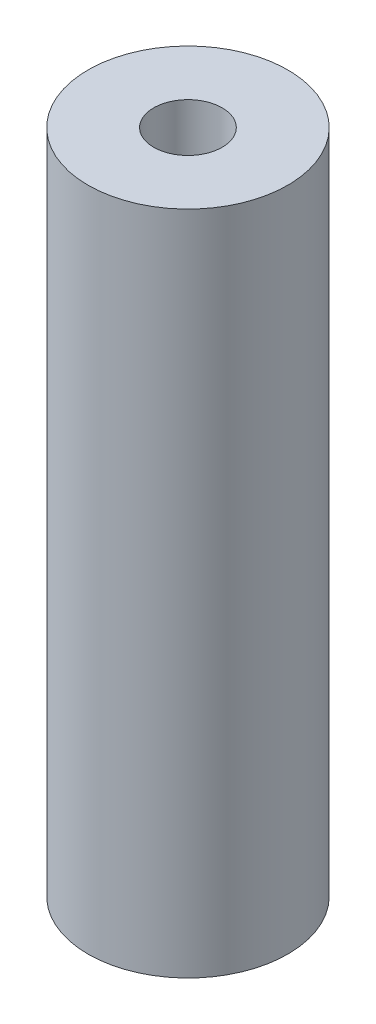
ISO-10303-21;
HEADER;
FILE_DESCRIPTION(('STEP AP214'),'2;1');
FILE_NAME('part.step','',(''),(''),'','','');
FILE_SCHEMA(('AUTOMOTIVE_DESIGN { 1 0 10303 214 1 1 1 1 }'));
ENDSEC;
DATA;
#1=APPLICATION_CONTEXT('core data for automotive mechanical design processes');
#2=APPLICATION_PROTOCOL_DEFINITION('international standard','automotive_design',2000,#1);
#3=PRODUCT_CONTEXT('',#1,'mechanical');
#4=PRODUCT('Part','Part','',(#3));
#5=PRODUCT_RELATED_PRODUCT_CATEGORY('part','',(#4));
#6=PRODUCT_DEFINITION_FORMATION('','',#4);
#7=PRODUCT_DEFINITION_CONTEXT('part definition',#1,'design');
#8=PRODUCT_DEFINITION('design','',#6,#7);
#9=PRODUCT_DEFINITION_SHAPE('','',#8);
#10=(LENGTH_UNIT() NAMED_UNIT(*) SI_UNIT(.MILLI.,.METRE.));
#11=(NAMED_UNIT(*) PLANE_ANGLE_UNIT() SI_UNIT($,.RADIAN.));
#12=(NAMED_UNIT(*) SI_UNIT($,.STERADIAN.) SOLID_ANGLE_UNIT());
#13=UNCERTAINTY_MEASURE_WITH_UNIT(LENGTH_MEASURE(1.E-05),#10,'distance_accuracy_value','');
#14=(GEOMETRIC_REPRESENTATION_CONTEXT(3) GLOBAL_UNCERTAINTY_ASSIGNED_CONTEXT((#13)) GLOBAL_UNIT_ASSIGNED_CONTEXT((#10,
#11,#12)) REPRESENTATION_CONTEXT('',''));
#15=CARTESIAN_POINT('',(0.,0.,0.));
#16=DIRECTION('',(0.,0.,1.));
#17=DIRECTION('',(1.,0.,0.));
#18=AXIS2_PLACEMENT_3D('',#15,#16,#17);
#19=CARTESIAN_POINT('',(0.,63.5,0.));
#20=DIRECTION('',(0.,1.,0.));
#21=DIRECTION('',(0.,0.,1.));
#22=AXIS2_PLACEMENT_3D('',#19,#20,#21);
#23=PLANE('',#22);
#24=CARTESIAN_POINT('',(0.,63.5,0.));
#25=DIRECTION('',(0.,1.,0.));
#26=DIRECTION('',(0.,0.,1.));
#27=AXIS2_PLACEMENT_3D('',#24,#25,#26);
#28=CIRCLE('',#27,9.525);
#29=CARTESIAN_POINT('',(0.,63.5,9.525));
#30=VERTEX_POINT('',#29);
#31=EDGE_CURVE('E10',#30,#30,#28,.T.);
#32=ORIENTED_EDGE('',*,*,#31,.T.);
#33=EDGE_LOOP('',(#32));
#34=FACE_BOUND('',#33,.T.);
#35=CARTESIAN_POINT('',(0.,63.5,0.));
#36=DIRECTION('',(0.,1.,0.));
#37=DIRECTION('',(0.,0.,1.));
#38=AXIS2_PLACEMENT_3D('',#35,#36,#37);
#39=CIRCLE('',#38,3.2639);
#40=CARTESIAN_POINT('',(0.,63.5,3.2639));
#41=VERTEX_POINT('',#40);
#42=EDGE_CURVE('E42',#41,#41,#39,.T.);
#43=ORIENTED_EDGE('',*,*,#42,.F.);
#44=EDGE_LOOP('',(#43));
#45=FACE_BOUND('',#44,.T.);
#46=ADVANCED_FACE('F31',(#34,#45),#23,.T.);
#47=CARTESIAN_POINT('',(0.,0.,0.));
#48=DIRECTION('',(0.,1.,0.));
#49=DIRECTION('',(0.,0.,1.));
#50=AXIS2_PLACEMENT_3D('',#47,#48,#49);
#51=PLANE('',#50);
#52=CARTESIAN_POINT('',(0.,0.,0.));
#53=DIRECTION('',(0.,1.,0.));
#54=DIRECTION('',(0.,0.,1.));
#55=AXIS2_PLACEMENT_3D('',#52,#53,#54);
#56=CIRCLE('',#55,9.525);
#57=CARTESIAN_POINT('',(0.,0.,9.525));
#58=VERTEX_POINT('',#57);
#59=EDGE_CURVE('E35',#58,#58,#56,.T.);
#60=ORIENTED_EDGE('',*,*,#59,.F.);
#61=EDGE_LOOP('',(#60));
#62=FACE_BOUND('',#61,.T.);
#63=CARTESIAN_POINT('',(0.,0.,0.));
#64=DIRECTION('',(0.,1.,0.));
#65=DIRECTION('',(0.,0.,1.));
#66=AXIS2_PLACEMENT_3D('',#63,#64,#65);
#67=CIRCLE('',#66,3.2639);
#68=CARTESIAN_POINT('',(0.,0.,3.2639));
#69=VERTEX_POINT('',#68);
#70=EDGE_CURVE('E44',#69,#69,#67,.T.);
#71=ORIENTED_EDGE('',*,*,#70,.T.);
#72=EDGE_LOOP('',(#71));
#73=FACE_BOUND('',#72,.T.);
#74=ADVANCED_FACE('F54',(#62,#73),#51,.F.);
#75=CARTESIAN_POINT('',(0.,63.5,0.));
#76=DIRECTION('',(0.,-1.,0.));
#77=DIRECTION('',(0.,0.,-1.));
#78=AXIS2_PLACEMENT_3D('',#75,#76,#77);
#79=CYLINDRICAL_SURFACE('',#78,9.525);
#80=ORIENTED_EDGE('',*,*,#31,.F.);
#81=EDGE_LOOP('',(#80));
#82=FACE_BOUND('',#81,.T.);
#83=ORIENTED_EDGE('',*,*,#59,.T.);
#84=EDGE_LOOP('',(#83));
#85=FACE_BOUND('',#84,.T.);
#86=ADVANCED_FACE('F33',(#82,#85),#79,.T.);
#87=CARTESIAN_POINT('',(0.,63.5,0.));
#88=DIRECTION('',(0.,-1.,0.));
#89=DIRECTION('',(0.,0.,-1.));
#90=AXIS2_PLACEMENT_3D('',#87,#88,#89);
#91=CYLINDRICAL_SURFACE('',#90,3.2639);
#92=ORIENTED_EDGE('',*,*,#42,.T.);
#93=EDGE_LOOP('',(#92));
#94=FACE_BOUND('',#93,.T.);
#95=ORIENTED_EDGE('',*,*,#70,.F.);
#96=EDGE_LOOP('',(#95));
#97=FACE_BOUND('',#96,.T.);
#98=ADVANCED_FACE('F50',(#94,#97),#91,.F.);
#99=CLOSED_SHELL('',(#46,#74,#86,#98));
#100=MANIFOLD_SOLID_BREP('B2',#99);
#101=ADVANCED_BREP_SHAPE_REPRESENTATION('',(#18,#100),#14);
#102=SHAPE_DEFINITION_REPRESENTATION(#9,#101);
ENDSEC;
END-ISO-10303-21;
